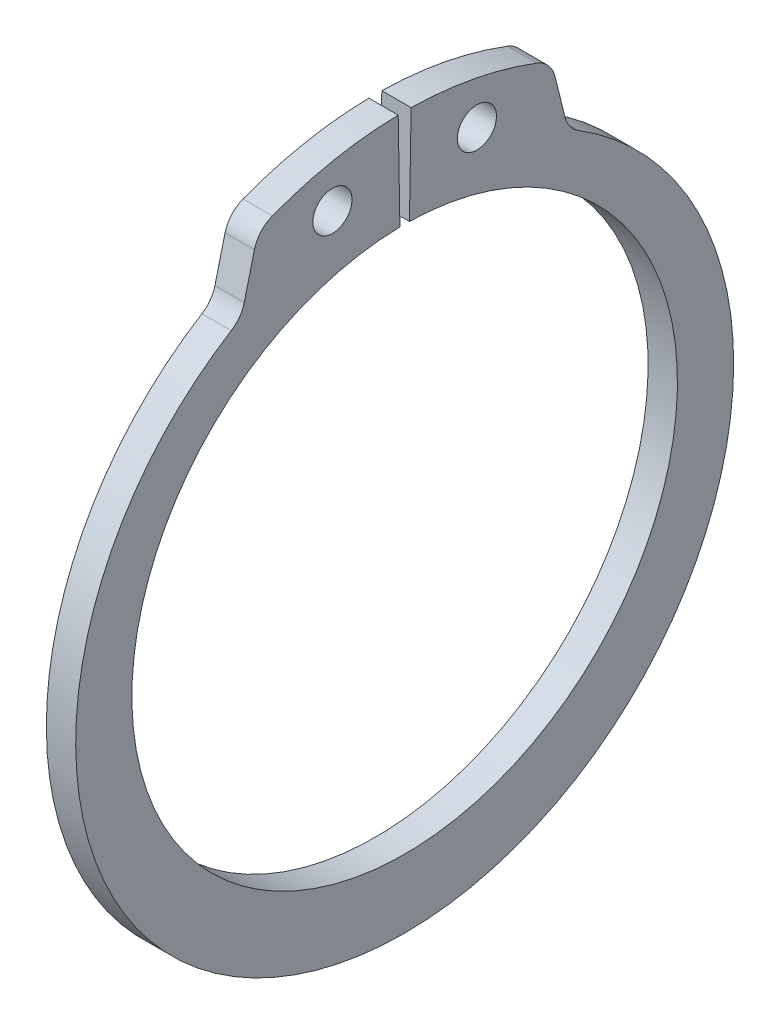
from build123d import *

# Parameters (mm, degrees)
SKETCH1_R      = 1
EXTRUDE1_DEPTH = 0.75
FILLET1_R      = 1.5


with BuildPart() as part:
    # Sketch1 → Extrude1 (new, symmetric)
    with BuildSketch(Plane(origin=(0, 0, 0), x_dir=(0, 0, -1), z_dir=(1, 0, 0))):
        with BuildLine():
            Line((-0.24346107, 13.947875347), (-0.330723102, 18.947113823))
            ThreePointArc((-0.330723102, 18.947113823), (-3.991022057, 18.524962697), (-7.500438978, 17.402468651))
            Line((-7.500438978, 17.402468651), (-8.354581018, 13.976692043))
            ThreePointArc((-8.354581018, 13.976692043), (0, -17.45), (8.354581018, 13.976692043))
            Line((8.354581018, 13.976692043), (7.500438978, 17.402468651))
            ThreePointArc((7.500438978, 17.402468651), (3.991022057, 18.524962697), (0.330723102, 18.947113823))
            Line((0.330723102, 18.947113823), (0.24346107, 13.947875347))
            ThreePointArc((0.24346107, 13.947875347), (0, -13.95), (-0.24346107, 13.947875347))
        make_face()
        with Locations((-3.694216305, 16.388023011)):
            Circle(SKETCH1_R, mode=Mode.SUBTRACT)
        with Locations((3.694216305, 16.388023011)):
            Circle(SKETCH1_R, mode=Mode.SUBTRACT)
    extrude(amount=EXTRUDE1_DEPTH, both=True)

    # Fillet1
    fillet1_edges = [part.edges().sort_by_distance(p)[0] for p in [
        (0, 17.402468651, -7.500438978),
        (0, 13.976692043, -8.354581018),
        (0, 13.976692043, 8.354581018),
        (0, 17.402468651, 7.500438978),
    ]]
    fillet(fillet1_edges, radius=FILLET1_R)


solid = part.part
